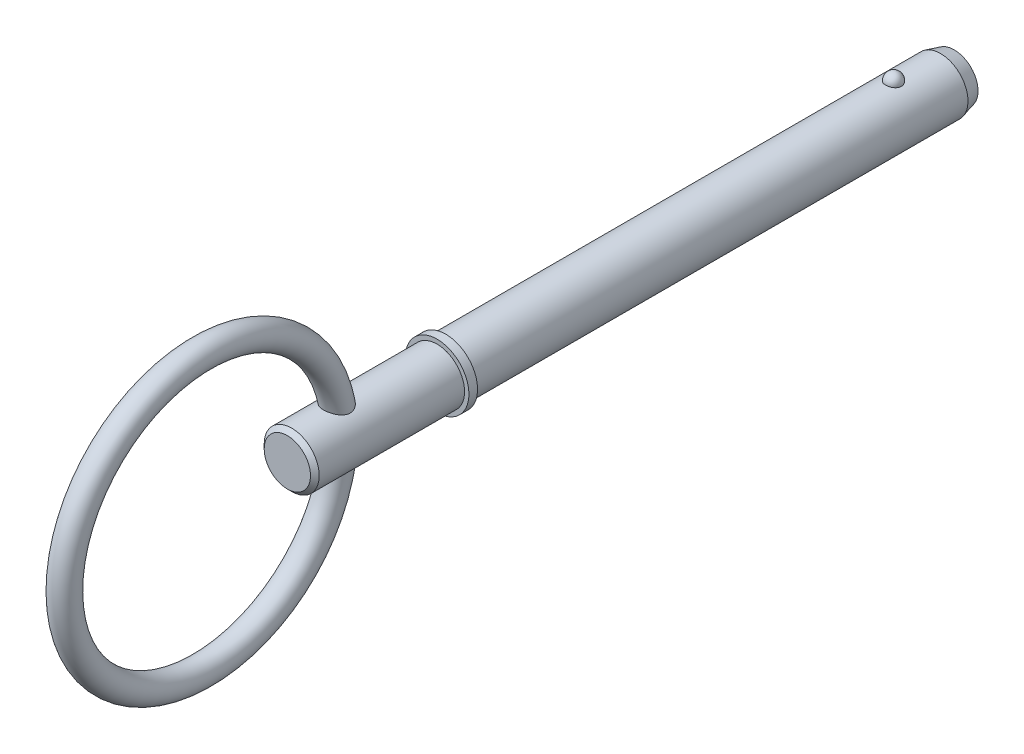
from build123d import *

# Parameters (mm, degrees)
SKETCH2_R           = 3.175
BOSS_EXTRUDE1_DEPTH = 50.8
BOSS_EXTRUDE2_START = 7.92
SKETCH3_R           = 3.175
BOSS_EXTRUDE2_DEPTH = 7.92
CHAMFER1_SIZE       = 1.586
CHAMFER1_SIZE2      = 0.424967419
SKETCH20_W          = 1
SKETCH20_H          = 3.675
SKETCH21_R          = 3.175
BOSS_EXTRUDE3_DEPTH = 18.29
CHAMFER2_SIZE       = 0.5
SKETCH24_R          = 1.5


with BuildPart() as part:
    # Sketch2 → Boss-Extrude1 (new body)
    with BuildSketch(Plane.XY):
        Circle(SKETCH2_R)
    extrude(amount=BOSS_EXTRUDE1_DEPTH)

    # Sketch3 → Boss-Extrude2 (add)
    with BuildSketch(Plane(origin=(0, 0, 0), x_dir=(-1, 0, 0), z_dir=(0, 0, -1)).offset(BOSS_EXTRUDE2_START)):
        Circle(SKETCH3_R)
    extrude(amount=-BOSS_EXTRUDE2_DEPTH)

    # Chamfer1
    chamfer1_edges = [part.edges().sort_by_distance(p)[0] for p in [
        (3.175, 0, -7.92),
    ]]
    chamfer1_side = [part.faces().sort_by_distance(p)[0] for p in [
        (3.175, 0, -3.96),
    ]]
    chamfer(chamfer1_edges, length=CHAMFER1_SIZE, length2=CHAMFER1_SIZE2, reference=chamfer1_side[0])

    # Sketch18 → Revolve1 (revolve)
    with BuildSketch(Plane(origin=(0, 0, 0), x_dir=(0, 0, -1), z_dir=(1, 0, 0))):
        with BuildLine():
            Line((0.91, 4.085), (0.91, 2.265))
            ThreePointArc((0.91, 2.265), (0, 3.175), (0.91, 4.085))
        make_face()
    revolve(axis=Axis((0, 4.085, -0.91), (0, -1, 0)))

    # Sketch20 → Revolve2 (revolve)
    with BuildSketch(Plane(origin=(0, 0, 0), x_dir=(0, 0, -1), z_dir=(1, 0, 0)), mode=Mode.PRIVATE) as revolve2_sk:
        with Locations((-51.3, 1.8375)):
            Rectangle(SKETCH20_W, SKETCH20_H)
    revolve(revolve2_sk.sketch.rotate(Axis((0, 0, 33.728787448), (0, 0, 1)), 90), axis=Axis((0, 0, 33.728787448), (0, 0, 1)))

    # Sketch21 → Boss-Extrude3 (add)
    with BuildSketch(Plane(origin=(0, 0, 50.8), x_dir=(-1, 0, 0), z_dir=(0, 0, -1))):
        Circle(SKETCH21_R)
    extrude(amount=-BOSS_EXTRUDE3_DEPTH)

    # Chamfer2
    chamfer2_edges = [part.edges().sort_by_distance(p)[0] for p in [
        (3.175, 0, 69.09),
    ]]
    chamfer(chamfer2_edges, length=CHAMFER2_SIZE)

    # Sweep1: sweep along a path in Sketch23
    with BuildLine(Plane(origin=(0, 0, 0), x_dir=(0, 0, -1), z_dir=(1, 0, 0))) as sweep1_path:
        CenterArc((-78.965, 0), 15.875, 0, 360)
    # Sketch24 → Sweep1 (sweep)
    with BuildSketch(Plane(origin=(0, 0, 0), x_dir=(1, 0, 0), z_dir=(0, 1, 0))):
        with Locations((0, -63.09)):
            Circle(SKETCH24_R)
    sweep(path=sweep1_path.line)


solid = part.part
